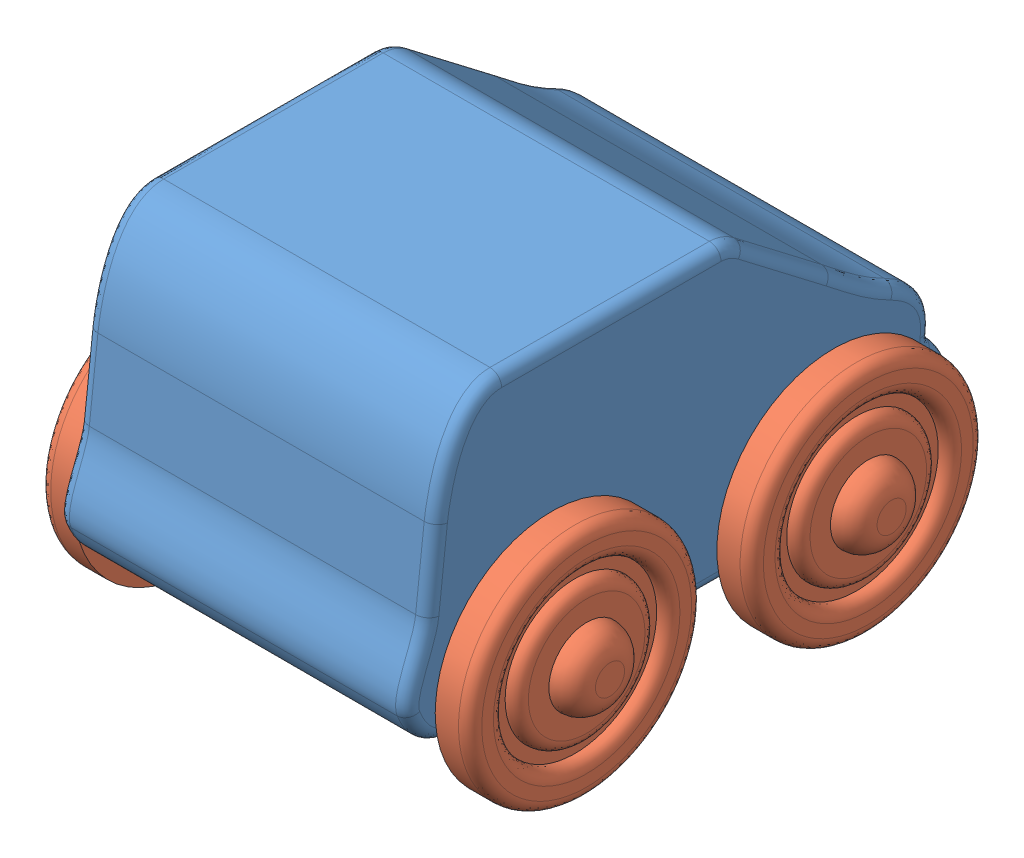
SolidWorks assembly Assem4.sldasm, configuration Default (file format 14000). Lengths in mm.
Overall size (41 32.38 48.44).
3 component instances, 2 part files, 4 mates.
Components (placement in the parent):
- Smart Car-1: Smart Car.SLDPRT [Default] at (9.946 -3.8287 -1.3026) size (30.04 25.85 48.44)
- Car Wheels-1: Car Wheels.SLDPRT [Default] at (9.946 -0.7259 11.8673) size (41 20 20)
- Car Wheels-2: Car Wheels.SLDPRT [Default] at (9.946 -0.7259 -12.3025) size (41 20 20)
Mates (geometry in assembly coordinates):
- Concentric1: concentric: cylinder of Smart Car-1 through (24.946 -0.7259 11.8673) axis (-1 0 0) radius 1.5; cylinder of Car Wheels-1 through (28.446 -0.7259 11.8673) axis (-1 0 0) radius 1.25
- Concentric2: concentric: cylinder of Smart Car-1 through (24.946 -0.7259 -12.3025) axis (-1 0 0) radius 1.5; cylinder of Car Wheels-2 through (28.446 -0.7259 -12.3025) axis (-1 0 0) radius 1.25
- Distance1: distance = 0.5 mm anti-aligned: plane of Car Wheels-2 through (-5.554 -0.7259 -12.3025) normal (1 0 0); plane of Smart Car-1 through (-5.054 -3.8287 -1.3026) normal (-1 0 0)
- Distance2: distance = 0.5 mm anti-aligned: plane of Car Wheels-1 through (-5.554 -0.7259 11.8673) normal (1 0 0); plane of Smart Car-1 through (-5.054 -3.8287 -1.3026) normal (-1 0 0)
